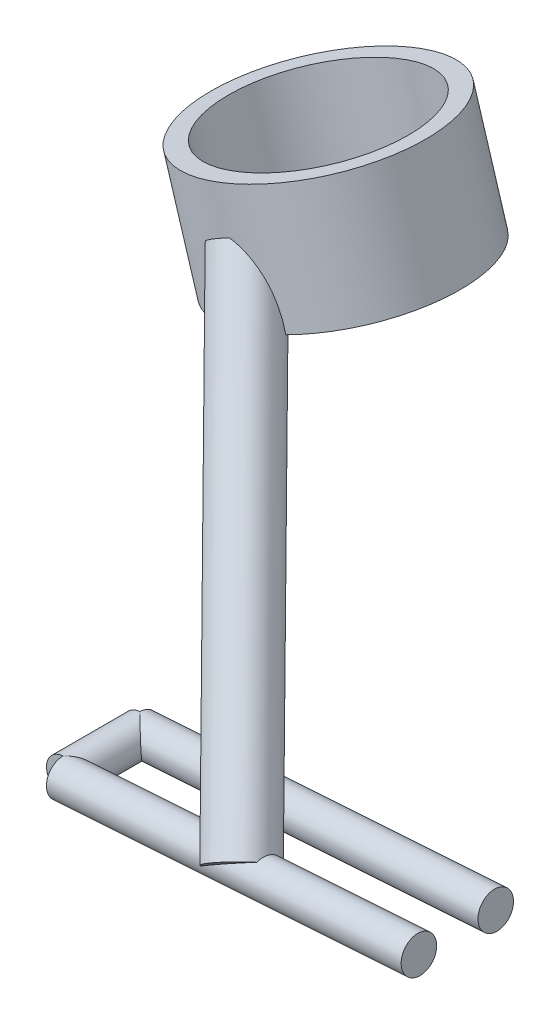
ISO-10303-21;
HEADER;
FILE_DESCRIPTION(('STEP AP214'),'2;1');
FILE_NAME('part.step','',(''),(''),'','','');
FILE_SCHEMA(('AUTOMOTIVE_DESIGN { 1 0 10303 214 1 1 1 1 }'));
ENDSEC;
DATA;
#1=APPLICATION_CONTEXT('core data for automotive mechanical design processes');
#2=APPLICATION_PROTOCOL_DEFINITION('international standard','automotive_design',2000,#1);
#3=PRODUCT_CONTEXT('',#1,'mechanical');
#4=PRODUCT('Part','Part','',(#3));
#5=PRODUCT_RELATED_PRODUCT_CATEGORY('part','',(#4));
#6=PRODUCT_DEFINITION_FORMATION('','',#4);
#7=PRODUCT_DEFINITION_CONTEXT('part definition',#1,'design');
#8=PRODUCT_DEFINITION('design','',#6,#7);
#9=PRODUCT_DEFINITION_SHAPE('','',#8);
#10=(LENGTH_UNIT() NAMED_UNIT(*) SI_UNIT(.MILLI.,.METRE.));
#11=(NAMED_UNIT(*) PLANE_ANGLE_UNIT() SI_UNIT($,.RADIAN.));
#12=(NAMED_UNIT(*) SI_UNIT($,.STERADIAN.) SOLID_ANGLE_UNIT());
#13=UNCERTAINTY_MEASURE_WITH_UNIT(LENGTH_MEASURE(1.E-05),#10,'distance_accuracy_value','');
#14=(GEOMETRIC_REPRESENTATION_CONTEXT(3) GLOBAL_UNCERTAINTY_ASSIGNED_CONTEXT((#13)) GLOBAL_UNIT_ASSIGNED_CONTEXT((#10,
#11,#12)) REPRESENTATION_CONTEXT('',''));
#15=CARTESIAN_POINT('',(0.,0.,0.));
#16=DIRECTION('',(0.,0.,1.));
#17=DIRECTION('',(1.,0.,0.));
#18=AXIS2_PLACEMENT_3D('',#15,#16,#17);
#19=CARTESIAN_POINT('',(-50.,118.,50.));
#20=DIRECTION('',(0.,0.,1.));
#21=DIRECTION('',(1.,0.,0.));
#22=AXIS2_PLACEMENT_3D('',#19,#20,#21);
#23=PLANE('',#22);
#24=CARTESIAN_POINT('',(-50.,118.,50.));
#25=DIRECTION('',(0.,0.,1.));
#26=DIRECTION('',(1.,0.,0.));
#27=AXIS2_PLACEMENT_3D('',#24,#25,#26);
#28=CIRCLE('',#27,3.);
#29=CARTESIAN_POINT('',(-50.1995570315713,120.99335547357,50.));
#30=VERTEX_POINT('',#29);
#31=CARTESIAN_POINT('',(-49.8004429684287,115.00664452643,50.));
#32=VERTEX_POINT('',#31);
#33=EDGE_CURVE('E399',#30,#32,#28,.T.);
#34=ORIENTED_EDGE('',*,*,#33,.T.);
#35=DIRECTION('',(-0.0665190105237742,0.997785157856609,0.));
#36=VECTOR('',#35,1.);
#37=CARTESIAN_POINT('',(-50.,118.,50.));
#38=LINE('',#37,#36);
#39=EDGE_CURVE('E201',#32,#30,#38,.T.);
#40=ORIENTED_EDGE('',*,*,#39,.T.);
#41=EDGE_LOOP('',(#34,#40));
#42=FACE_BOUND('',#41,.T.);
#43=ADVANCED_FACE('F70',(#42),#23,.T.);
#44=CARTESIAN_POINT('',(-50.,118.,37.));
#45=DIRECTION('',(0.997785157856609,0.0665190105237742,0.));
#46=DIRECTION('',(-0.0665190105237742,0.997785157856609,0.));
#47=AXIS2_PLACEMENT_3D('',#44,#45,#46);
#48=PLANE('',#47);
#49=DIRECTION('',(0.0665190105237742,-0.997785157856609,0.));
#50=VECTOR('',#49,1.);
#51=CARTESIAN_POINT('',(-50.,118.,37.));
#52=LINE('',#51,#50);
#53=CARTESIAN_POINT('',(-50.1995570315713,120.99335547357,37.));
#54=VERTEX_POINT('',#53);
#55=CARTESIAN_POINT('',(-49.8004429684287,115.00664452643,37.));
#56=VERTEX_POINT('',#55);
#57=EDGE_CURVE('E250',#54,#56,#52,.T.);
#58=ORIENTED_EDGE('',*,*,#57,.F.);
#59=CARTESIAN_POINT('',(-50.,118.,37.));
#60=DIRECTION('',(0.997785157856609,0.0665190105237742,0.));
#61=DIRECTION('',(-0.0665190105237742,0.997785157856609,0.));
#62=AXIS2_PLACEMENT_3D('',#59,#60,#61);
#63=CIRCLE('',#62,3.);
#64=EDGE_CURVE('E246',#56,#54,#63,.T.);
#65=ORIENTED_EDGE('',*,*,#64,.F.);
#66=EDGE_LOOP('',(#58,#65));
#67=FACE_BOUND('',#66,.T.);
#68=ADVANCED_FACE('F72',(#67),#48,.F.);
#69=CARTESIAN_POINT('',(10.,122.,37.));
#70=DIRECTION('',(0.997785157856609,0.0665190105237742,0.));
#71=DIRECTION('',(-0.0665190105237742,0.997785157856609,0.));
#72=AXIS2_PLACEMENT_3D('',#69,#70,#71);
#73=PLANE('',#72);
#74=CARTESIAN_POINT('',(10.,122.,37.));
#75=DIRECTION('',(0.997785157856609,0.0665190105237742,0.));
#76=DIRECTION('',(-0.0665190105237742,0.997785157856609,0.));
#77=AXIS2_PLACEMENT_3D('',#74,#75,#76);
#78=CIRCLE('',#77,3.);
#79=CARTESIAN_POINT('',(9.80044296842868,124.99335547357,37.));
#80=VERTEX_POINT('',#79);
#81=EDGE_CURVE('E243',#80,#80,#78,.T.);
#82=ORIENTED_EDGE('',*,*,#81,.T.);
#83=EDGE_LOOP('',(#82));
#84=FACE_BOUND('',#83,.T.);
#85=ADVANCED_FACE('F224',(#84),#73,.T.);
#86=CARTESIAN_POINT('',(-50.,118.,37.));
#87=DIRECTION('',(0.997785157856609,0.066519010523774,0.));
#88=DIRECTION('',(-0.066519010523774,0.997785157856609,0.));
#89=AXIS2_PLACEMENT_3D('',#86,#87,#88);
#90=CYLINDRICAL_SURFACE('',#89,3.);
#91=CARTESIAN_POINT('',(-50.,118.,37.));
#92=DIRECTION('',(0.705540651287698,0.0470360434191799,-0.707106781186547));
#93=DIRECTION('',(0.705540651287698,0.0470360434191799,0.707106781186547));
#94=AXIS2_PLACEMENT_3D('',#91,#92,#93);
#95=ELLIPSE('',#94,4.24264068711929,3.);
#96=EDGE_CURVE('E245',#56,#54,#95,.F.);
#97=ORIENTED_EDGE('',*,*,#96,.F.);
#98=ORIENTED_EDGE('',*,*,#64,.T.);
#99=EDGE_LOOP('',(#97,#98));
#100=FACE_BOUND('',#99,.T.);
#101=ORIENTED_EDGE('',*,*,#81,.F.);
#102=EDGE_LOOP('',(#101));
#103=FACE_BOUND('',#102,.T.);
#104=ADVANCED_FACE('F226',(#100,#103),#90,.T.);
#105=CARTESIAN_POINT('',(-50.,118.,37.));
#106=DIRECTION('',(0.,0.,1.));
#107=DIRECTION('',(1.,0.,0.));
#108=AXIS2_PLACEMENT_3D('',#105,#106,#107);
#109=PLANE('',#108);
#110=CARTESIAN_POINT('',(-50.,118.,37.));
#111=DIRECTION('',(0.,0.,1.));
#112=DIRECTION('',(1.,0.,0.));
#113=AXIS2_PLACEMENT_3D('',#110,#111,#112);
#114=CIRCLE('',#113,3.);
#115=EDGE_CURVE('E397',#54,#56,#114,.T.);
#116=ORIENTED_EDGE('',*,*,#115,.F.);
#117=ORIENTED_EDGE('',*,*,#57,.T.);
#118=EDGE_LOOP('',(#116,#117));
#119=FACE_BOUND('',#118,.T.);
#120=ADVANCED_FACE('F231',(#119),#109,.F.);
#121=CARTESIAN_POINT('',(-50.,118.,37.));
#122=DIRECTION('',(0.,0.,1.));
#123=DIRECTION('',(1.,0.,0.));
#124=AXIS2_PLACEMENT_3D('',#121,#122,#123);
#125=CYLINDRICAL_SURFACE('',#124,3.);
#126=CARTESIAN_POINT('',(-50.,118.,50.));
#127=DIRECTION('',(0.705540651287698,0.0470360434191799,0.707106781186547));
#128=DIRECTION('',(-0.705540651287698,-0.0470360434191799,0.707106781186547));
#129=AXIS2_PLACEMENT_3D('',#126,#127,#128);
#130=ELLIPSE('',#129,4.24264068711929,3.);
#131=EDGE_CURVE('E84',#32,#30,#130,.T.);
#132=ORIENTED_EDGE('',*,*,#131,.F.);
#133=ORIENTED_EDGE('',*,*,#33,.F.);
#134=EDGE_LOOP('',(#132,#133));
#135=FACE_BOUND('',#134,.T.);
#136=ORIENTED_EDGE('',*,*,#115,.T.);
#137=ORIENTED_EDGE('',*,*,#96,.T.);
#138=EDGE_LOOP('',(#136,#137));
#139=FACE_BOUND('',#138,.T.);
#140=ADVANCED_FACE('F229',(#135,#139),#125,.T.);
#141=CARTESIAN_POINT('',(-20.,120.,50.));
#142=DIRECTION('',(0.4544555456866,-0.75878267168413,0.466603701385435));
#143=DIRECTION('',(0.,-0.523820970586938,-0.851828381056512));
#144=AXIS2_PLACEMENT_3D('',#141,#142,#143);
#145=PLANE('',#144);
#146=CARTESIAN_POINT('',(-20.,120.,50.));
#147=DIRECTION('',(0.4544555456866,-0.75878267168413,0.466603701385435));
#148=DIRECTION('',(0.890123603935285,0.406780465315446,-0.205449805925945));
#149=AXIS2_PLACEMENT_3D('',#146,#147,#148);
#150=ELLIPSE('',#149,7.44462084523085,3.);
#151=CARTESIAN_POINT('',(-16.1920073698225,123.013296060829,51.1913181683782));
#152=VERTEX_POINT('',#151);
#153=CARTESIAN_POINT('',(-23.9727166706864,119.457564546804,52.9871869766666));
#154=VERTEX_POINT('',#153);
#155=EDGE_CURVE('E267',#152,#154,#150,.T.);
#156=ORIENTED_EDGE('',*,*,#155,.F.);
#157=CARTESIAN_POINT('',(-20.,120.,50.));
#158=DIRECTION('',(0.4544555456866,-0.75878267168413,0.466603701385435));
#159=DIRECTION('',(0.,-0.523820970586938,-0.851828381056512));
#160=AXIS2_PLACEMENT_3D('',#157,#158,#159);
#161=CIRCLE('',#160,4.99999999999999);
#162=EDGE_CURVE('E148',#152,#154,#161,.T.);
#163=ORIENTED_EDGE('',*,*,#162,.T.);
#164=EDGE_LOOP('',(#156,#163));
#165=FACE_BOUND('',#164,.T.);
#166=ADVANCED_FACE('F277',(#165),#145,.T.);
#167=CARTESIAN_POINT('',(-51.165048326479,167.353332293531,0.));
#168=DIRECTION('',(-0.292371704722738,0.956304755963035,0.));
#169=DIRECTION('',(-0.956304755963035,-0.292371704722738,0.));
#170=AXIS2_PLACEMENT_3D('',#167,#168,#169);
#171=PLANE('',#170);
#172=CARTESIAN_POINT('',(-48.7951496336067,168.077883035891,20.4351205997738));
#173=DIRECTION('',(-0.292371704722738,0.956304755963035,0.));
#174=DIRECTION('',(0.396739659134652,0.121295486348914,0.909881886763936));
#175=AXIS2_PLACEMENT_3D('',#172,#173,#174);
#176=ELLIPSE('',#175,5.82412932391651,4.99999999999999);
#177=CARTESIAN_POINT('',(-44.7359402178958,169.31890789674,17.7708492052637));
#178=VERTEX_POINT('',#177);
#179=CARTESIAN_POINT('',(-47.136958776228,168.584842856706,15.3319234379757));
#180=VERTEX_POINT('',#179);
#181=EDGE_CURVE('E140',#178,#180,#176,.T.);
#182=ORIENTED_EDGE('',*,*,#181,.T.);
#183=CARTESIAN_POINT('',(-51.165048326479,167.353332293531,0.));
#184=DIRECTION('',(-0.292371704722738,0.956304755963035,0.));
#185=DIRECTION('',(-0.956304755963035,-0.292371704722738,0.));
#186=AXIS2_PLACEMENT_3D('',#183,#184,#185);
#187=CIRCLE('',#186,15.9);
#188=CARTESIAN_POINT('',(-52.1660859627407,167.047284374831,15.8655052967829));
#189=VERTEX_POINT('',#188);
#190=EDGE_CURVE('E89',#180,#189,#187,.T.);
#191=ORIENTED_EDGE('',*,*,#190,.T.);
#192=CARTESIAN_POINT('',(-53.6483426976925,166.594113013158,18.8217118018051));
#193=VERTEX_POINT('',#192);
#194=EDGE_CURVE('E138',#189,#193,#176,.T.);
#195=ORIENTED_EDGE('',*,*,#194,.T.);
#196=CARTESIAN_POINT('',(-51.165048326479,167.353332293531,0.));
#197=DIRECTION('',(-0.292371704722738,0.956304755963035,0.));
#198=DIRECTION('',(-0.956304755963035,-0.292371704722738,0.));
#199=AXIS2_PLACEMENT_3D('',#196,#197,#198);
#200=CIRCLE('',#199,19.);
#201=EDGE_CURVE('E150',#178,#193,#200,.T.);
#202=ORIENTED_EDGE('',*,*,#201,.F.);
#203=EDGE_LOOP('',(#182,#191,#195,#202));
#204=FACE_BOUND('',#203,.T.);
#205=ADVANCED_FACE('F136',(#204),#171,.F.);
#206=CARTESIAN_POINT('',(-57.0124824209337,186.479427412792,0.));
#207=DIRECTION('',(-0.292371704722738,0.956304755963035,0.));
#208=DIRECTION('',(-0.956304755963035,-0.292371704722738,0.));
#209=AXIS2_PLACEMENT_3D('',#206,#207,#208);
#210=PLANE('',#209);
#211=CARTESIAN_POINT('',(-57.0124824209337,186.479427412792,0.));
#212=DIRECTION('',(-0.292371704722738,0.956304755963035,0.));
#213=DIRECTION('',(-0.956304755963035,-0.292371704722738,0.));
#214=AXIS2_PLACEMENT_3D('',#211,#212,#213);
#215=CIRCLE('',#214,15.9);
#216=CARTESIAN_POINT('',(-72.217728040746,181.8307173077,0.));
#217=VERTEX_POINT('',#216);
#218=EDGE_CURVE('E141',#217,#217,#215,.T.);
#219=ORIENTED_EDGE('',*,*,#218,.F.);
#220=EDGE_LOOP('',(#219));
#221=FACE_BOUND('',#220,.T.);
#222=CARTESIAN_POINT('',(-57.0124824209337,186.479427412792,0.));
#223=DIRECTION('',(-0.292371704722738,0.956304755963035,0.));
#224=DIRECTION('',(-0.956304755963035,-0.292371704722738,0.));
#225=AXIS2_PLACEMENT_3D('',#222,#223,#224);
#226=CIRCLE('',#225,19.);
#227=CARTESIAN_POINT('',(-75.1822727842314,180.92436502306,0.));
#228=VERTEX_POINT('',#227);
#229=EDGE_CURVE('E157',#228,#228,#226,.T.);
#230=ORIENTED_EDGE('',*,*,#229,.T.);
#231=EDGE_LOOP('',(#230));
#232=FACE_BOUND('',#231,.T.);
#233=ADVANCED_FACE('F290',(#221,#232),#210,.T.);
#234=CARTESIAN_POINT('',(-51.165048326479,167.353332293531,0.));
#235=DIRECTION('',(-0.292371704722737,0.956304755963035,0.));
#236=DIRECTION('',(-0.956304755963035,-0.292371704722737,0.));
#237=AXIS2_PLACEMENT_3D('',#234,#235,#236);
#238=CYLINDRICAL_SURFACE('',#237,19.);
#239=CARTESIAN_POINT('',(-44.7359402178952,169.31890789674,17.7708492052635));
#240=CARTESIAN_POINT('',(-44.7981550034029,169.57158532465,17.765398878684));
#241=CARTESIAN_POINT('',(-44.8653622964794,169.823064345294,17.7618880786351));
#242=CARTESIAN_POINT('',(-45.0094854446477,170.323251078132,17.7586950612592));
#243=CARTESIAN_POINT('',(-45.0864013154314,170.571958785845,17.7590128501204));
#244=CARTESIAN_POINT('',(-45.2497979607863,171.066630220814,17.7634301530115));
#245=CARTESIAN_POINT('',(-45.3362941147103,171.312588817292,17.7675358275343));
#246=CARTESIAN_POINT('',(-45.5186437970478,171.800903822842,17.7794796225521));
#247=CARTESIAN_POINT('',(-45.6144973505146,172.043260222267,17.7873177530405));
#248=CARTESIAN_POINT('',(-45.917987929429,172.768832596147,17.8165212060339));
#249=CARTESIAN_POINT('',(-46.1400283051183,173.245911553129,17.8435327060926));
#250=CARTESIAN_POINT('',(-46.6231111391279,174.178490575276,17.9116670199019));
#251=CARTESIAN_POINT('',(-46.8841215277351,174.634007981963,17.9527782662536));
#252=CARTESIAN_POINT('',(-47.3393952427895,175.347808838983,18.0293637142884));
#253=CARTESIAN_POINT('',(-47.5208546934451,175.614721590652,18.0609506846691));
#254=CARTESIAN_POINT('',(-47.9002340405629,176.136102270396,18.1283275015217));
#255=CARTESIAN_POINT('',(-48.0981539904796,176.390570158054,18.1641173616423));
#256=CARTESIAN_POINT('',(-48.5108207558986,176.884194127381,18.2390648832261));
#257=CARTESIAN_POINT('',(-48.7255360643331,177.123377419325,18.2782162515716));
#258=CARTESIAN_POINT('',(-49.172855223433,177.583944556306,18.3589085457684));
#259=CARTESIAN_POINT('',(-49.4054526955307,177.805334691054,18.4004486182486));
#260=CARTESIAN_POINT('',(-49.8129447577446,178.160173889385,18.4712832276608));
#261=CARTESIAN_POINT('',(-49.9829159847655,178.299345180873,18.5003101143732));
#262=CARTESIAN_POINT('',(-50.3317121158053,178.566100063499,18.5582802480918));
#263=CARTESIAN_POINT('',(-50.5105347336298,178.693686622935,18.5872235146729));
#264=CARTESIAN_POINT('',(-50.876449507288,178.935079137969,18.6442698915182));
#265=CARTESIAN_POINT('',(-51.0635081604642,179.048934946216,18.6723757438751));
#266=CARTESIAN_POINT('',(-51.4463185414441,179.261230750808,18.7270755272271));
#267=CARTESIAN_POINT('',(-51.6420664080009,179.359677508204,18.7536701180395));
#268=CARTESIAN_POINT('',(-52.0531993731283,179.543606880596,18.8058826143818));
#269=CARTESIAN_POINT('',(-52.2690709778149,179.628062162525,18.8313636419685));
#270=CARTESIAN_POINT('',(-52.5995407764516,179.736929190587,18.8666916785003));
#271=CARTESIAN_POINT('',(-52.711065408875,179.770303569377,18.8780075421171));
#272=CARTESIAN_POINT('',(-52.9360823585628,179.830437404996,18.8994860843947));
#273=CARTESIAN_POINT('',(-53.0495761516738,179.857191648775,18.9096478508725));
#274=CARTESIAN_POINT('',(-53.1639136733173,179.880325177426,18.9191424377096));
#275=B_SPLINE_CURVE_WITH_KNOTS('',3,(#239,#240,#241,#242,#243,#244,#245,#246,#247,#248,#249,
#250,#251,#252,#253,#254,#255,#256,#257,#258,#259,#260,#261,#262,#263,#264,#265,#266,#267,#268,
#269,#270,#271,#272,#273,#274),.UNSPECIFIED.,.F.,.F.,(4,2,2,2,2,2,2,2,2,2,2,2,2,2,2,2,2,4),(0.,
0.780768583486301,1.56153842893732,2.34358033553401,3.12562433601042,4.70432229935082,
6.28172818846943,7.25403359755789,8.22634216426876,9.19686857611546,10.1670503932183,
10.8314035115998,11.4955859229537,12.1572792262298,12.8186813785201,13.5169181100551,
13.8676129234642,14.2185830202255),.UNSPECIFIED.);
#276=CARTESIAN_POINT('',(-53.163913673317,179.880325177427,18.9191424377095));
#277=VERTEX_POINT('',#276);
#278=EDGE_CURVE('E183',#178,#277,#275,.T.);
#279=ORIENTED_EDGE('',*,*,#278,.F.);
#280=ORIENTED_EDGE('',*,*,#201,.T.);
#281=CARTESIAN_POINT('',(-57.3721179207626,177.259150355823,18.7552768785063));
#282=CARTESIAN_POINT('',(-57.3925154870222,177.153268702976,18.7470928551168));
#283=CARTESIAN_POINT('',(-57.4093735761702,177.046729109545,18.7392281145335));
#284=CARTESIAN_POINT('',(-57.4366442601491,176.832863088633,18.724180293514));
#285=CARTESIAN_POINT('',(-57.4470621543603,176.725537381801,18.716996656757));
#286=CARTESIAN_POINT('',(-57.4620874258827,176.510880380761,18.7033677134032));
#287=CARTESIAN_POINT('',(-57.4667177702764,176.403550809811,18.6969195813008));
#288=CARTESIAN_POINT('',(-57.4708081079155,176.188739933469,18.6847345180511));
#289=CARTESIAN_POINT('',(-57.4702669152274,176.081258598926,18.678997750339));
#290=CARTESIAN_POINT('',(-57.4617447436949,175.762093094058,18.6630070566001));
#291=CARTESIAN_POINT('',(-57.4470526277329,175.550522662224,18.6537730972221));
#292=CARTESIAN_POINT('',(-57.4028215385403,175.128666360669,18.6379013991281));
#293=CARTESIAN_POINT('',(-57.3732634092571,174.918382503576,18.6312670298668));
#294=CARTESIAN_POINT('',(-57.3055911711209,174.522218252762,18.6209699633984));
#295=CARTESIAN_POINT('',(-57.2687256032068,174.336126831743,18.6170658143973));
#296=CARTESIAN_POINT('',(-57.1864986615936,173.965784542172,18.6109977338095));
#297=CARTESIAN_POINT('',(-57.141135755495,173.781534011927,18.6088341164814));
#298=CARTESIAN_POINT('',(-57.0430153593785,173.414984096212,18.606080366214));
#299=CARTESIAN_POINT('',(-56.9902567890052,173.232685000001,18.605490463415));
#300=CARTESIAN_POINT('',(-56.878217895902,172.870094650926,18.6057243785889));
#301=CARTESIAN_POINT('',(-56.8189368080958,172.689803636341,18.6065483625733));
#302=CARTESIAN_POINT('',(-56.6307276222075,172.147136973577,18.6109503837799));
#303=CARTESIAN_POINT('',(-56.4927876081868,171.787882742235,18.6164875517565));
#304=CARTESIAN_POINT('',(-56.1974474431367,171.077756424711,18.6315938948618));
#305=CARTESIAN_POINT('',(-56.0400514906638,170.726882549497,18.6411622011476));
#306=CARTESIAN_POINT('',(-55.7142407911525,170.045380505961,18.662952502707));
#307=CARTESIAN_POINT('',(-55.5464014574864,169.714472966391,18.6750703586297));
#308=CARTESIAN_POINT('',(-55.1966307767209,169.060277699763,18.7013410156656));
#309=CARTESIAN_POINT('',(-55.0146987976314,168.736990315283,18.7154939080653));
#310=CARTESIAN_POINT('',(-54.6421762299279,168.105893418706,18.744742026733));
#311=CARTESIAN_POINT('',(-54.451897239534,167.797898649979,18.7598065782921));
#312=CARTESIAN_POINT('',(-54.1573837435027,167.341875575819,18.7828285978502));
#313=CARTESIAN_POINT('',(-54.0577062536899,167.19087623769,18.7905727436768));
#314=CARTESIAN_POINT('',(-53.8553082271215,166.89093342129,18.8061194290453));
#315=CARTESIAN_POINT('',(-53.7525876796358,166.741989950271,18.8139219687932));
#316=CARTESIAN_POINT('',(-53.6483426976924,166.594113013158,18.8217118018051));
#317=B_SPLINE_CURVE_WITH_KNOTS('',3,(#281,#282,#283,#284,#285,#286,#287,#288,#289,#290,#291,
#292,#293,#294,#295,#296,#297,#298,#299,#300,#301,#302,#303,#304,#305,#306,#307,#308,#309,#310,
#311,#312,#313,#314,#315,#316),.UNSPECIFIED.,.F.,.F.,(4,2,2,2,2,2,2,2,2,2,2,2,2,2,2,2,2,4),(0.,
0.324286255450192,0.648305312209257,0.97103441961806,1.29383753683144,1.92994926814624,
2.56688278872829,3.1358939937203,3.7050079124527,4.27420505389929,4.8434690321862,
5.9972587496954,7.15079991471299,8.26412718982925,9.37750442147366,10.4642247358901,
11.0074857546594,11.5507486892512),.UNSPECIFIED.);
#318=CARTESIAN_POINT('',(-57.3721179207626,177.259150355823,18.7552768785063));
#319=VERTEX_POINT('',#318);
#320=EDGE_CURVE('E147',#319,#193,#317,.T.);
#321=ORIENTED_EDGE('',*,*,#320,.F.);
#322=CARTESIAN_POINT('',(-51.705152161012,169.119932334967,0.));
#323=DIRECTION('',(0.4544555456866,-0.75878267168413,0.466603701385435));
#324=DIRECTION('',(0.190666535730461,0.594542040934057,0.781131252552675));
#325=AXIS2_PLACEMENT_3D('',#322,#323,#324);
#326=ELLIPSE('',#325,22.1316914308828,19.);
#327=EDGE_CURVE('E166',#319,#277,#326,.F.);
#328=ORIENTED_EDGE('',*,*,#327,.T.);
#329=EDGE_LOOP('',(#279,#280,#321,#328));
#330=FACE_BOUND('',#329,.T.);
#331=ORIENTED_EDGE('',*,*,#229,.F.);
#332=EDGE_LOOP('',(#331));
#333=FACE_BOUND('',#332,.T.);
#334=ADVANCED_FACE('F168',(#330,#333),#238,.T.);
#335=CARTESIAN_POINT('',(-54.0887653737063,176.916379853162,15.));
#336=DIRECTION('',(0.4544555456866,-0.75878267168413,0.466603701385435));
#337=DIRECTION('',(0.,-0.523820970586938,-0.851828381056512));
#338=AXIS2_PLACEMENT_3D('',#335,#336,#337);
#339=PLANE('',#338);
#340=ORIENTED_EDGE('',*,*,#327,.F.);
#341=CARTESIAN_POINT('',(-54.0887653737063,176.916379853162,15.));
#342=DIRECTION('',(0.4544555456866,-0.75878267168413,0.466603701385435));
#343=DIRECTION('',(0.,-0.523820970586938,-0.851828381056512));
#344=AXIS2_PLACEMENT_3D('',#341,#342,#343);
#345=CIRCLE('',#344,4.99999999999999);
#346=EDGE_CURVE('E268',#277,#319,#345,.T.);
#347=ORIENTED_EDGE('',*,*,#346,.F.);
#348=EDGE_LOOP('',(#340,#347));
#349=FACE_BOUND('',#348,.T.);
#350=ADVANCED_FACE('F208',(#349),#339,.F.);
#351=CARTESIAN_POINT('',(-23.8079926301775,116.986703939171,48.8086818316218));
#352=VERTEX_POINT('',#351);
#353=CARTESIAN_POINT('',(-16.0272833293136,120.542435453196,47.0128130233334));
#354=VERTEX_POINT('',#353);
#355=EDGE_CURVE('E261',#352,#354,#150,.T.);
#356=ORIENTED_EDGE('',*,*,#355,.F.);
#357=EDGE_CURVE('E152',#352,#354,#161,.T.);
#358=ORIENTED_EDGE('',*,*,#357,.T.);
#359=EDGE_LOOP('',(#356,#358));
#360=FACE_BOUND('',#359,.T.);
#361=ADVANCED_FACE('F177',(#360),#145,.T.);
#362=CARTESIAN_POINT('',(-54.0887653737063,176.916379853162,15.));
#363=DIRECTION('',(0.4544555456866,-0.75878267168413,0.466603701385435));
#364=DIRECTION('',(0.,-0.523820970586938,-0.851828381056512));
#365=AXIS2_PLACEMENT_3D('',#362,#363,#364);
#366=CYLINDRICAL_SURFACE('',#365,4.99999999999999);
#367=CARTESIAN_POINT('',(-49.8418224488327,179.551060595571,15.1480985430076));
#368=CARTESIAN_POINT('',(-49.7058619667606,179.333061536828,15.1269414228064));
#369=CARTESIAN_POINT('',(-49.5747597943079,179.111932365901,15.1071092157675));
#370=CARTESIAN_POINT('',(-49.3220923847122,178.664093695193,15.0703340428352));
#371=CARTESIAN_POINT('',(-49.2005258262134,178.437384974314,15.05339067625));
#372=CARTESIAN_POINT('',(-48.966667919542,177.97891916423,15.0226207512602));
#373=CARTESIAN_POINT('',(-48.8543801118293,177.747160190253,15.0087953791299));
#374=CARTESIAN_POINT('',(-48.6390182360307,177.279248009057,14.984434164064));
#375=CARTESIAN_POINT('',(-48.5359445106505,177.043094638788,14.9738984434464));
#376=CARTESIAN_POINT('',(-48.2391830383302,176.325790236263,14.9473194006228));
#377=CARTESIAN_POINT('',(-48.0593634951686,175.838570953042,14.9364934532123));
#378=CARTESIAN_POINT('',(-47.8179762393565,175.098728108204,14.931168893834));
#379=CARTESIAN_POINT('',(-47.7422418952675,174.850629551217,14.9312127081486));
#380=CARTESIAN_POINT('',(-47.6004888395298,174.35169899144,14.9349858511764));
#381=CARTESIAN_POINT('',(-47.5344692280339,174.100867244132,14.9387148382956));
#382=CARTESIAN_POINT('',(-47.4056799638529,173.568244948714,14.950544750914));
#383=CARTESIAN_POINT('',(-47.3441276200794,173.286168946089,14.9590934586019));
#384=CARTESIAN_POINT('',(-47.234580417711,172.719571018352,14.9808904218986));
#385=CARTESIAN_POINT('',(-47.1865849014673,172.435049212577,14.9941384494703));
#386=CARTESIAN_POINT('',(-47.1056618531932,171.864497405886,15.0253914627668));
#387=CARTESIAN_POINT('',(-47.0727143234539,171.578469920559,15.0433900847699));
#388=CARTESIAN_POINT('',(-47.0239597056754,171.005314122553,15.0842486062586));
#389=CARTESIAN_POINT('',(-47.0081469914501,170.718186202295,15.1071069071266));
#390=CARTESIAN_POINT('',(-46.9992557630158,170.260547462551,15.1475142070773));
#391=CARTESIAN_POINT('',(-46.9995539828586,170.09001541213,15.1634513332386));
#392=CARTESIAN_POINT('',(-47.0083777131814,169.749352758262,15.1971127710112));
#393=CARTESIAN_POINT('',(-47.0169015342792,169.579222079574,15.2148367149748));
#394=CARTESIAN_POINT('',(-47.0434498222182,169.240024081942,15.2520853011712));
#395=CARTESIAN_POINT('',(-47.0614659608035,169.070955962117,15.2716083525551));
#396=CARTESIAN_POINT('',(-47.108712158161,168.734655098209,15.3124744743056));
#397=CARTESIAN_POINT('',(-47.1379370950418,168.567421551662,15.3338167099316));
#398=CARTESIAN_POINT('',(-47.216345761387,168.206303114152,15.3823037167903));
#399=CARTESIAN_POINT('',(-47.2681690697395,168.013017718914,15.4098026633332));
#400=CARTESIAN_POINT('',(-47.3958020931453,167.634690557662,15.4671207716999));
#401=CARTESIAN_POINT('',(-47.4715840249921,167.449639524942,15.4969372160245));
#402=CARTESIAN_POINT('',(-47.6271838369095,167.147392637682,15.549189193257));
#403=CARTESIAN_POINT('',(-47.6992954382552,167.026216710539,15.5712238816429));
#404=CARTESIAN_POINT('',(-47.8613974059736,166.796453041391,15.6155010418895));
#405=CARTESIAN_POINT('',(-47.9513545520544,166.687842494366,15.6377430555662));
#406=CARTESIAN_POINT('',(-48.1301840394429,166.509527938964,15.6769936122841));
#407=CARTESIAN_POINT('',(-48.215581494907,166.436399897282,15.6941492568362));
#408=CARTESIAN_POINT('',(-48.3977049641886,166.305613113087,15.7272196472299));
#409=CARTESIAN_POINT('',(-48.494419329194,166.247938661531,15.7431356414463));
#410=CARTESIAN_POINT('',(-48.6970437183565,166.150498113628,15.7730324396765));
#411=CARTESIAN_POINT('',(-48.8029737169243,166.11077213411,15.7870088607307));
#412=CARTESIAN_POINT('',(-49.0203655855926,166.050029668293,15.8124728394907));
#413=CARTESIAN_POINT('',(-49.131832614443,166.029030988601,15.8239580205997));
#414=CARTESIAN_POINT('',(-49.3864156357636,166.00120095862,15.846933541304));
#415=CARTESIAN_POINT('',(-49.5301482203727,165.999545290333,15.8576314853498));
#416=CARTESIAN_POINT('',(-49.8162709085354,166.018908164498,15.8750972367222));
#417=CARTESIAN_POINT('',(-49.9586578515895,166.039970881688,15.8818573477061));
#418=CARTESIAN_POINT('',(-50.2159439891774,166.094577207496,15.8911845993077));
#419=CARTESIAN_POINT('',(-50.3314305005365,166.125418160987,15.8942664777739));
#420=CARTESIAN_POINT('',(-50.5594374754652,166.1968329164,15.8984792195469));
#421=CARTESIAN_POINT('',(-50.6719557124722,166.237413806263,15.8996086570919));
#422=CARTESIAN_POINT('',(-50.8940806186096,166.32649959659,15.9002206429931));
#423=CARTESIAN_POINT('',(-51.0036797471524,166.37502306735,15.8996992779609));
#424=CARTESIAN_POINT('',(-51.2197432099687,166.478455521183,15.8972592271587));
#425=CARTESIAN_POINT('',(-51.3262083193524,166.533362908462,15.8953408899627));
#426=CARTESIAN_POINT('',(-51.5718183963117,166.667973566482,15.8894679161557));
#427=CARTESIAN_POINT('',(-51.709801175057,166.749770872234,15.8850433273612));
#428=CARTESIAN_POINT('',(-51.9809988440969,166.920866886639,15.874470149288));
#429=CARTESIAN_POINT('',(-52.1142116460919,167.010168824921,15.8683208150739));
#430=CARTESIAN_POINT('',(-52.3764625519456,167.194972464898,15.8545968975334));
#431=CARTESIAN_POINT('',(-52.5054942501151,167.290483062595,15.8470202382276));
#432=CARTESIAN_POINT('',(-52.7595945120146,167.486557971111,15.8306888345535));
#433=CARTESIAN_POINT('',(-52.8846623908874,167.587123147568,15.8219338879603));
#434=CARTESIAN_POINT('',(-53.2564719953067,167.896854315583,15.7940522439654));
#435=CARTESIAN_POINT('',(-53.4976958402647,168.11252338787,15.7734272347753));
#436=CARTESIAN_POINT('',(-53.9674913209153,168.556428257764,15.7294374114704));
#437=CARTESIAN_POINT('',(-54.1960731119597,168.784653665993,15.7060748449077));
#438=CARTESIAN_POINT('',(-54.6167273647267,169.22434938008,15.6602489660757));
#439=CARTESIAN_POINT('',(-54.8099733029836,169.434723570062,15.6379917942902));
#440=CARTESIAN_POINT('',(-55.1888194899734,169.86216373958,15.5924615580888));
#441=CARTESIAN_POINT('',(-55.3744188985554,170.079230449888,15.5691883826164));
#442=CARTESIAN_POINT('',(-55.738693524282,170.519349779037,15.5220141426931));
#443=CARTESIAN_POINT('',(-55.9173623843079,170.742407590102,15.4981125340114));
#444=CARTESIAN_POINT('',(-56.2680051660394,171.193700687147,15.4500683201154));
#445=CARTESIAN_POINT('',(-56.4399789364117,171.421936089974,15.4259257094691));
#446=CARTESIAN_POINT('',(-56.7711008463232,171.874424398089,15.3786580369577));
#447=CARTESIAN_POINT('',(-56.9304880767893,172.098502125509,15.3555289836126));
#448=CARTESIAN_POINT('',(-57.2433864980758,172.550763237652,15.309678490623));
#449=CARTESIAN_POINT('',(-57.3968976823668,172.778946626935,15.2869570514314));
#450=CARTESIAN_POINT('',(-57.6977281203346,173.238767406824,15.2422824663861));
#451=CARTESIAN_POINT('',(-57.8450593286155,173.470396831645,15.2203278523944));
#452=CARTESIAN_POINT('',(-58.1336905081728,173.937475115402,15.1774820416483));
#453=CARTESIAN_POINT('',(-58.274990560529,174.172923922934,15.1565908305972));
#454=CARTESIAN_POINT('',(-58.4131923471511,174.410242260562,15.1364027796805));
#455=B_SPLINE_CURVE_WITH_KNOTS('',3,(#367,#368,#369,#370,#371,#372,#373,#374,#375,#376,#377,
#378,#379,#380,#381,#382,#383,#384,#385,#386,#387,#388,#389,#390,#391,#392,#393,#394,#395,#396,
#397,#398,#399,#400,#401,#402,#403,#404,#405,#406,#407,#408,#409,#410,#411,#412,#413,#414,#415,
#416,#417,#418,#419,#420,#421,#422,#423,#424,#425,#426,#427,#428,#429,#430,#431,#432,#433,#434,
#435,#436,#437,#438,#439,#440,#441,#442,#443,#444,#445,#446,#447,#448,#449,#450,#451,#452,#453,
#454),.UNSPECIFIED.,.F.,.F.,(4,2,2,2,2,2,2,2,2,2,2,2,2,2,2,2,2,2,2,2,2,2,2,2,2,2,2,2,2,2,2,2,2,
2,2,2,2,2,2,2,2,2,2,4),(0.,0.773269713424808,1.54643208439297,2.31988811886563,3.09337290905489,
4.64967186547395,5.42771019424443,6.2056764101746,7.07185462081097,7.93799080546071,
8.80297258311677,9.6676702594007,10.1813281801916,10.6948806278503,11.2079832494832,
11.7208516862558,12.3257047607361,12.9298589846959,13.356772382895,13.7828983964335,
14.1226645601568,14.4620840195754,14.8022584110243,15.1427559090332,15.5727666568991,
16.0036150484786,16.3618301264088,16.720306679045,17.0796336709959,17.4388710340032,
17.9199406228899,18.401218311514,18.8832014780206,19.365267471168,20.3372450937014,
21.3084302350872,22.167802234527,23.0272684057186,23.8875051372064,24.7477613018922,
25.5755254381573,26.4032904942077,27.2293725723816,28.0554435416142),.UNSPECIFIED.);
#456=EDGE_CURVE('E12',#180,#189,#455,.T.);
#457=ORIENTED_EDGE('',*,*,#456,.F.);
#458=ORIENTED_EDGE('',*,*,#181,.F.);
#459=ORIENTED_EDGE('',*,*,#278,.T.);
#460=ORIENTED_EDGE('',*,*,#346,.T.);
#461=ORIENTED_EDGE('',*,*,#320,.T.);
#462=ORIENTED_EDGE('',*,*,#194,.F.);
#463=EDGE_LOOP('',(#457,#458,#459,#460,#461,#462));
#464=FACE_BOUND('',#463,.T.);
#465=CARTESIAN_POINT('',(-26.5232161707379,122.571778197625,50.));
#466=CARTESIAN_POINT('',(-26.5862414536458,122.567577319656,49.8800293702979));
#467=CARTESIAN_POINT('',(-26.6445665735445,122.556486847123,49.7576946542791));
#468=CARTESIAN_POINT('',(-26.7484102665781,122.518968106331,49.5096596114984));
#469=CARTESIAN_POINT('',(-26.7939197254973,122.492528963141,49.3839569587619));
#470=CARTESIAN_POINT('',(-26.8498921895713,122.440347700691,49.1945133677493));
#471=CARTESIAN_POINT('',(-26.866558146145,122.420723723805,49.1308647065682));
#472=CARTESIAN_POINT('',(-26.895199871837,122.37722073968,49.003981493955));
#473=CARTESIAN_POINT('',(-26.9071780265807,122.353343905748,48.9407467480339));
#474=CARTESIAN_POINT('',(-26.9260565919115,122.301392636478,48.8153224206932));
#475=CARTESIAN_POINT('',(-26.932962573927,122.273322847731,48.7531317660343));
#476=CARTESIAN_POINT('',(-26.9414699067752,122.213147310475,48.6303870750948));
#477=CARTESIAN_POINT('',(-26.9430720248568,122.181042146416,48.5698328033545));
#478=CARTESIAN_POINT('',(-26.9399857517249,122.087146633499,48.4057290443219));
#479=CARTESIAN_POINT('',(-26.9295893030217,122.021343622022,48.3044899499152));
#480=CARTESIAN_POINT('',(-26.8926457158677,121.880284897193,48.1121411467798));
#481=CARTESIAN_POINT('',(-26.8660921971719,121.805025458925,48.0210354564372));
#482=CARTESIAN_POINT('',(-26.8000728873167,121.650287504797,47.8535546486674));
#483=CARTESIAN_POINT('',(-26.7610584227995,121.571027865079,47.7767948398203));
#484=CARTESIAN_POINT('',(-26.6723534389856,121.408259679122,47.6349608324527));
#485=CARTESIAN_POINT('',(-26.6226597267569,121.324749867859,47.5698901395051));
#486=CARTESIAN_POINT('',(-26.4837139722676,121.10579954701,47.4167601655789));
#487=CARTESIAN_POINT('',(-26.3882337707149,120.968328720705,47.3372535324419));
#488=CARTESIAN_POINT('',(-26.1842229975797,120.690220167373,47.2043576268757));
#489=CARTESIAN_POINT('',(-26.0756521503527,120.549573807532,47.1510516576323));
#490=CARTESIAN_POINT('',(-25.8883801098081,120.313477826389,47.0820582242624));
#491=CARTESIAN_POINT('',(-25.8115830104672,120.218358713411,47.0597654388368));
#492=CARTESIAN_POINT('',(-25.6562049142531,120.027637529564,47.0255598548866));
#493=CARTESIAN_POINT('',(-25.577623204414,119.932035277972,47.0136512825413));
#494=CARTESIAN_POINT('',(-25.4200390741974,119.740448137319,47.000017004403));
#495=CARTESIAN_POINT('',(-25.3410366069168,119.644463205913,46.998292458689));
#496=CARTESIAN_POINT('',(-25.1839404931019,119.452147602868,47.0050845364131));
#497=CARTESIAN_POINT('',(-25.1058465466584,119.355817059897,47.0135976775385));
#498=CARTESIAN_POINT('',(-24.9687378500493,119.183893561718,47.0381853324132));
#499=CARTESIAN_POINT('',(-24.9092782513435,119.108362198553,47.0522045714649));
#500=CARTESIAN_POINT('',(-24.7924936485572,118.957199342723,47.086969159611));
#501=CARTESIAN_POINT('',(-24.7351691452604,118.881567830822,47.1077160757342));
#502=CARTESIAN_POINT('',(-24.5678781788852,118.655080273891,47.1804888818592));
#503=CARTESIAN_POINT('',(-24.4621908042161,118.504136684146,47.2431128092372));
#504=CARTESIAN_POINT('',(-24.2916454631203,118.239534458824,47.3819822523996));
#505=CARTESIAN_POINT('',(-24.2229460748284,118.125104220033,47.4520254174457));
#506=CARTESIAN_POINT('',(-24.1005210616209,117.901880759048,47.6115617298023));
#507=CARTESIAN_POINT('',(-24.0467810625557,117.793082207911,47.7010360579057));
#508=CARTESIAN_POINT('',(-23.9560432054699,117.585198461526,47.8988966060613));
#509=CARTESIAN_POINT('',(-23.9191158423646,117.486155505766,48.0073598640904));
#510=CARTESIAN_POINT('',(-23.8618066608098,117.302975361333,48.2401436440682));
#511=CARTESIAN_POINT('',(-23.8414338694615,117.218846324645,48.3644727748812));
#512=CARTESIAN_POINT('',(-23.8151902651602,117.073338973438,48.6177622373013));
#513=CARTESIAN_POINT('',(-23.8085703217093,117.010949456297,48.746071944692));
#514=CARTESIAN_POINT('',(-23.804311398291,116.904495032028,49.0101899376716));
#515=CARTESIAN_POINT('',(-23.8066747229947,116.860434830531,49.1460001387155));
#516=CARTESIAN_POINT('',(-23.817671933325,116.788191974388,49.4363763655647));
#517=CARTESIAN_POINT('',(-23.8269230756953,116.762096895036,49.5914390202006));
#518=CARTESIAN_POINT('',(-23.8486040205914,116.734222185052,49.9035335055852));
#519=CARTESIAN_POINT('',(-23.8610349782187,116.73245140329,50.0605660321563));
#520=CARTESIAN_POINT('',(-23.8869996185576,116.754269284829,50.3847653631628));
#521=CARTESIAN_POINT('',(-23.9005459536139,116.779774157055,50.5518066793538));
#522=CARTESIAN_POINT('',(-23.9251013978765,116.858762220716,50.8793371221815));
#523=CARTESIAN_POINT('',(-23.9361106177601,116.912244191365,51.0398265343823));
#524=CARTESIAN_POINT('',(-23.9539163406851,117.0452914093,51.34833056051));
#525=CARTESIAN_POINT('',(-23.9607460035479,117.124643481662,51.4964351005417));
#526=CARTESIAN_POINT('',(-23.9698803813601,117.307253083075,51.7772275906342));
#527=CARTESIAN_POINT('',(-23.9721854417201,117.410508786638,51.9099167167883));
#528=CARTESIAN_POINT('',(-23.9729558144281,117.636184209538,52.1543275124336));
#529=CARTESIAN_POINT('',(-23.9714752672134,117.758310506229,52.2663205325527));
#530=CARTESIAN_POINT('',(-23.9665133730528,118.019289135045,52.46872100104));
#531=CARTESIAN_POINT('',(-23.9630316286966,118.158144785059,52.5591241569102));
#532=CARTESIAN_POINT('',(-23.956749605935,118.451533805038,52.7175505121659));
#533=CARTESIAN_POINT('',(-23.9539636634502,118.606316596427,52.7851116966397));
#534=CARTESIAN_POINT('',(-23.9531452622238,118.925166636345,52.8935972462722));
#535=CARTESIAN_POINT('',(-23.9551141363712,119.089236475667,52.9345141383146));
#536=CARTESIAN_POINT('',(-23.9653043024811,119.338049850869,52.9748433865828));
#537=CARTESIAN_POINT('',(-23.9698988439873,119.421353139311,52.9847793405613));
#538=CARTESIAN_POINT('',(-23.9821490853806,119.588264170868,52.9976207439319));
#539=CARTESIAN_POINT('',(-23.989803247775,119.671871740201,53.0005297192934));
#540=CARTESIAN_POINT('',(-24.0087869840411,119.838530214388,52.999312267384));
#541=CARTESIAN_POINT('',(-24.0201126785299,119.921581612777,52.9951932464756));
#542=CARTESIAN_POINT('',(-24.0469864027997,120.086361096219,52.9800452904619));
#543=CARTESIAN_POINT('',(-24.0625338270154,120.168089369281,52.9690173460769));
#544=CARTESIAN_POINT('',(-24.0964275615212,120.321147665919,52.9417658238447));
#545=CARTESIAN_POINT('',(-24.1143295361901,120.392691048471,52.9261833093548));
#546=CARTESIAN_POINT('',(-24.1540032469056,120.533403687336,52.8899315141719));
#547=CARTESIAN_POINT('',(-24.1757762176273,120.602572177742,52.8692606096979));
#548=CARTESIAN_POINT('',(-24.2231661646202,120.73792928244,52.8232206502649));
#549=CARTESIAN_POINT('',(-24.2487815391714,120.804119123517,52.7978535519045));
#550=CARTESIAN_POINT('',(-24.3036944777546,120.933124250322,52.7428525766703));
#551=CARTESIAN_POINT('',(-24.3329934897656,120.995938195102,52.7132170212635));
#552=CARTESIAN_POINT('',(-24.4227504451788,121.172410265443,52.6219107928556));
#553=CARTESIAN_POINT('',(-24.4876457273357,121.281314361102,52.5552884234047));
#554=CARTESIAN_POINT('',(-24.6269577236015,121.484909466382,52.4113410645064));
#555=CARTESIAN_POINT('',(-24.7013804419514,121.579591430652,52.334009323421));
#556=CARTESIAN_POINT('',(-24.8401044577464,121.736242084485,52.1883838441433));
#557=CARTESIAN_POINT('',(-24.90315076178,121.800870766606,52.1217115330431));
#558=CARTESIAN_POINT('',(-25.032060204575,121.921984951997,51.9837826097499));
#559=CARTESIAN_POINT('',(-25.0979247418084,121.978466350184,51.9125237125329));
#560=CARTESIAN_POINT('',(-25.2314975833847,122.083768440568,51.7656785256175));
#561=CARTESIAN_POINT('',(-25.2992110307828,122.132564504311,51.6900793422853));
#562=CARTESIAN_POINT('',(-25.4352267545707,122.222549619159,51.5350306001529));
#563=CARTESIAN_POINT('',(-25.503528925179,122.263740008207,51.4555817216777));
#564=CARTESIAN_POINT('',(-25.6416658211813,122.339705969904,51.2906636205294));
#565=CARTESIAN_POINT('',(-25.7114904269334,122.37427161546,51.2050884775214));
#566=CARTESIAN_POINT('',(-25.8496746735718,122.43548121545,51.0300507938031));
#567=CARTESIAN_POINT('',(-25.9180338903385,122.462122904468,50.9405871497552));
#568=CARTESIAN_POINT('',(-26.1187208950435,122.529633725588,50.6670931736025));
#569=CARTESIAN_POINT('',(-26.2474965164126,122.558540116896,50.4769888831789));
#570=CARTESIAN_POINT('',(-26.3931431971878,122.571639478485,50.234051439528));
#571=CARTESIAN_POINT('',(-26.4200747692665,122.57312238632,50.187791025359));
#572=CARTESIAN_POINT('',(-26.4726550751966,122.574022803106,50.0944772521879));
#573=CARTESIAN_POINT('',(-26.4983028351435,122.573438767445,50.0474233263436));
#574=CARTESIAN_POINT('',(-26.5232161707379,122.571778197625,50.));
#575=B_SPLINE_CURVE_WITH_KNOTS('',3,(#465,#466,#467,#468,#469,#470,#471,#472,#473,#474,#475,
#476,#477,#478,#479,#480,#481,#482,#483,#484,#485,#486,#487,#488,#489,#490,#491,#492,#493,#494,
#495,#496,#497,#498,#499,#500,#501,#502,#503,#504,#505,#506,#507,#508,#509,#510,#511,#512,#513,
#514,#515,#516,#517,#518,#519,#520,#521,#522,#523,#524,#525,#526,#527,#528,#529,#530,#531,#532,
#533,#534,#535,#536,#537,#538,#539,#540,#541,#542,#543,#544,#545,#546,#547,#548,#549,#550,#551,
#552,#553,#554,#555,#556,#557,#558,#559,#560,#561,#562,#563,#564,#565,#566,#567,#568,#569,#570,
#571,#572,#573,#574),.UNSPECIFIED.,.T.,.F.,(4,2,2,2,2,2,2,2,2,2,2,2,2,2,2,2,2,2,2,2,2,2,2,2,2,2,
2,2,2,2,2,2,2,2,2,2,2,2,2,2,2,2,2,2,2,2,2,2,2,2,2,2,2,2,4),(0.,0.406615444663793,
0.813519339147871,1.01924682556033,1.22486948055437,1.4302659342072,1.63563267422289,
1.99712254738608,2.3587552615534,2.70854525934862,3.05843998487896,3.61124863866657,
4.1658037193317,4.53818543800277,4.91071863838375,5.28329427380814,5.65574321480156,
5.94692174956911,6.23816815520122,6.81875440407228,7.26916543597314,7.71914217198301,
8.17098865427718,8.62308136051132,9.04982325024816,9.47667462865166,9.94723061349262,
10.4179577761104,10.924068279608,11.4301567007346,11.9321760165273,12.4341570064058,
12.928999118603,13.4239395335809,13.9283635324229,14.4329289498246,14.6847009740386,
14.9363466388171,15.1877272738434,15.4390718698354,15.6649018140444,15.890803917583,
16.1166121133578,16.3425093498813,16.7703791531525,17.1985199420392,17.5347886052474,
17.871226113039,18.2087207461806,18.5461559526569,18.8929626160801,19.239868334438,
19.9296372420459,20.090248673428,20.2509801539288),.UNSPECIFIED.);
#576=EDGE_CURVE('E195',#154,#352,#575,.T.);
#577=ORIENTED_EDGE('',*,*,#576,.F.);
#578=ORIENTED_EDGE('',*,*,#162,.F.);
#579=CARTESIAN_POINT('',(-16.1435824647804,123.263753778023,50.));
#580=CARTESIAN_POINT('',(-16.1561610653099,123.262910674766,50.1625512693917));
#581=CARTESIAN_POINT('',(-16.1679671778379,123.248845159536,50.3253134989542));
#582=CARTESIAN_POINT('',(-16.1862222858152,123.194696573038,50.6470885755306));
#583=CARTESIAN_POINT('',(-16.1926581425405,123.15455011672,50.806091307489));
#584=CARTESIAN_POINT('',(-16.1954533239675,123.049201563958,51.1163619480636));
#585=CARTESIAN_POINT('',(-16.1917803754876,122.983919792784,51.2676035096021));
#586=CARTESIAN_POINT('',(-16.169191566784,122.830766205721,51.5567711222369));
#587=CARTESIAN_POINT('',(-16.150302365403,122.742934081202,51.6947199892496));
#588=CARTESIAN_POINT('',(-16.0954401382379,122.556099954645,51.9430001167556));
#589=CARTESIAN_POINT('',(-16.0608395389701,122.45841131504,52.0546213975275));
#590=CARTESIAN_POINT('',(-15.9742717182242,122.25196722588,52.2593120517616));
#591=CARTESIAN_POINT('',(-15.9223050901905,122.143212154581,52.3523820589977));
#592=CARTESIAN_POINT('',(-15.8064902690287,121.926417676,52.5135191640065));
#593=CARTESIAN_POINT('',(-15.743575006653,121.81874952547,52.5827761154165));
#594=CARTESIAN_POINT('',(-15.6067509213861,121.600845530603,52.7043211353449));
#595=CARTESIAN_POINT('',(-15.5328339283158,121.490607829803,52.7565965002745));
#596=CARTESIAN_POINT('',(-15.3946451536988,121.294378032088,52.8352496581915));
#597=CARTESIAN_POINT('',(-15.331945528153,121.208511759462,52.8648079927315));
#598=CARTESIAN_POINT('',(-15.203072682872,121.036759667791,52.9149544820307));
#599=CARTESIAN_POINT('',(-15.1368989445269,120.950873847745,52.9355412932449));
#600=CARTESIAN_POINT('',(-15.0020729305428,120.77909361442,52.968245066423));
#601=CARTESIAN_POINT('',(-14.9334146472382,120.693199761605,52.9803398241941));
#602=CARTESIAN_POINT('',(-14.7948237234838,120.521708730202,52.9962990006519));
#603=CARTESIAN_POINT('',(-14.7248912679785,120.436111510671,53.0001646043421));
#604=CARTESIAN_POINT('',(-14.5827187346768,120.262812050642,52.9998198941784));
#605=CARTESIAN_POINT('',(-14.510469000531,120.175118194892,52.995379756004));
#606=CARTESIAN_POINT('',(-14.3665969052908,120.000039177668,52.9779478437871));
#607=CARTESIAN_POINT('',(-14.2949746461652,119.912654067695,52.9649547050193));
#608=CARTESIAN_POINT('',(-14.1535155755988,119.738409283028,52.9302379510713));
#609=CARTESIAN_POINT('',(-14.0836758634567,119.651548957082,52.9085296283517));
#610=CARTESIAN_POINT('',(-13.9468207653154,119.478408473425,52.856021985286));
#611=CARTESIAN_POINT('',(-13.8798042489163,119.39212809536,52.8252263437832));
#612=CARTESIAN_POINT('',(-13.7240911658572,119.186374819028,52.7399118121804));
#613=CARTESIAN_POINT('',(-13.6373112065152,119.067279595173,52.6808276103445));
#614=CARTESIAN_POINT('',(-13.4761829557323,118.832537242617,52.5423314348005));
#615=CARTESIAN_POINT('',(-13.4018164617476,118.716885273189,52.4629496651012));
#616=CARTESIAN_POINT('',(-13.2839496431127,118.514424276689,52.300603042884));
#617=CARTESIAN_POINT('',(-13.2372532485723,118.426438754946,52.2214605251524));
#618=CARTESIAN_POINT('',(-13.1585584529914,118.257237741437,52.0497121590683));
#619=CARTESIAN_POINT('',(-13.1265472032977,118.176016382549,51.9571181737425));
#620=CARTESIAN_POINT('',(-13.079753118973,118.022817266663,51.7594881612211));
#621=CARTESIAN_POINT('',(-13.0650848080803,117.950903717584,51.6543744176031));
#622=CARTESIAN_POINT('',(-13.0546683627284,117.819867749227,51.4355911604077));
#623=CARTESIAN_POINT('',(-13.0589170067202,117.760743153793,51.3219231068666));
#624=CARTESIAN_POINT('',(-13.0841519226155,117.662275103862,51.1020186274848));
#625=CARTESIAN_POINT('',(-13.1034020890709,117.62153587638,50.9961931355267));
#626=CARTESIAN_POINT('',(-13.1547517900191,117.5519777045,50.783794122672));
#627=CARTESIAN_POINT('',(-13.1868568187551,117.523163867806,50.6772203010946));
#628=CARTESIAN_POINT('',(-13.2771635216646,117.467472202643,50.4217250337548));
#629=CARTESIAN_POINT('',(-13.3406673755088,117.446283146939,50.2734469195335));
#630=CARTESIAN_POINT('',(-13.4828987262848,117.424310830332,49.9827326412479));
#631=CARTESIAN_POINT('',(-13.5616608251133,117.423574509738,49.8403106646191));
#632=CARTESIAN_POINT('',(-13.7044939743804,117.43773758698,49.603936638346));
#633=CARTESIAN_POINT('',(-13.7660221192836,117.448077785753,49.5081054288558));
#634=CARTESIAN_POINT('',(-13.8927623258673,117.477131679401,49.3201690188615));
#635=CARTESIAN_POINT('',(-13.9579759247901,117.49584889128,49.2280654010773));
#636=CARTESIAN_POINT('',(-14.0909664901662,117.541272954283,49.0475172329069));
#637=CARTESIAN_POINT('',(-14.158747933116,117.567994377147,48.9590796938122));
#638=CARTESIAN_POINT('',(-14.2956777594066,117.629189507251,48.78605633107));
#639=CARTESIAN_POINT('',(-14.3648259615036,117.663662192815,48.7014700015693));
#640=CARTESIAN_POINT('',(-14.5054555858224,117.741426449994,48.5338215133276));
#641=CARTESIAN_POINT('',(-14.5769473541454,117.784941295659,48.4508714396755));
#642=CARTESIAN_POINT('',(-14.7192014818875,117.880315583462,48.2892051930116));
#643=CARTESIAN_POINT('',(-14.7899636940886,117.932176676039,48.2104898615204));
#644=CARTESIAN_POINT('',(-14.9293796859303,118.044439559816,48.0577975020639));
#645=CARTESIAN_POINT('',(-14.9980380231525,118.104821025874,47.983809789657));
#646=CARTESIAN_POINT('',(-15.132030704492,118.234592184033,47.840981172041));
#647=CARTESIAN_POINT('',(-15.1973668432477,118.303976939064,47.7721374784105));
#648=CARTESIAN_POINT('',(-15.3447580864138,118.477507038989,47.6179106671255));
#649=CARTESIAN_POINT('',(-15.4249185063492,118.585438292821,47.5348911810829));
#650=CARTESIAN_POINT('',(-15.5725923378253,118.818504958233,47.3828491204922));
#651=CARTESIAN_POINT('',(-15.6401238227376,118.943615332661,47.3138065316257));
#652=CARTESIAN_POINT('',(-15.7297196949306,119.143207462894,47.2235877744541));
#653=CARTESIAN_POINT('',(-15.7577337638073,119.212062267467,47.1956441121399));
#654=CARTESIAN_POINT('',(-15.8095200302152,119.353155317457,47.1448705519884));
#655=CARTESIAN_POINT('',(-15.8332940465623,119.425392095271,47.1220384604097));
#656=CARTESIAN_POINT('',(-15.876547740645,119.572673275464,47.0819391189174));
#657=CARTESIAN_POINT('',(-15.8960258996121,119.647718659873,47.0646738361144));
#658=CARTESIAN_POINT('',(-15.9308201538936,119.799850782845,47.0360682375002));
#659=CARTESIAN_POINT('',(-15.9461364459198,119.876937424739,47.0247276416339));
#660=CARTESIAN_POINT('',(-15.9834980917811,120.093969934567,47.0016936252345));
#661=CARTESIAN_POINT('',(-16.0012932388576,120.235440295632,46.9968064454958));
#662=CARTESIAN_POINT('',(-16.0271977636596,120.518412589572,47.0072992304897));
#663=CARTESIAN_POINT('',(-16.0353039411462,120.659914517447,47.0226858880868));
#664=CARTESIAN_POINT('',(-16.045365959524,120.949229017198,47.0750857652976));
#665=CARTESIAN_POINT('',(-16.0468566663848,121.096799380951,47.1135237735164));
#666=CARTESIAN_POINT('',(-16.0459988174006,121.384480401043,47.2121263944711));
#667=CARTESIAN_POINT('',(-16.0436488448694,121.524588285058,47.2722990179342));
#668=CARTESIAN_POINT('',(-16.0378010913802,121.80745999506,47.4199912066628));
#669=CARTESIAN_POINT('',(-16.0342130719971,121.949126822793,47.5096201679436));
#670=CARTESIAN_POINT('',(-16.0289194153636,122.215625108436,47.7111854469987));
#671=CARTESIAN_POINT('',(-16.0272137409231,122.340456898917,47.8231213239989));
#672=CARTESIAN_POINT('',(-16.0275410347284,122.570705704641,48.0674282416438));
#673=CARTESIAN_POINT('',(-16.0296083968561,122.675934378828,48.1999770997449));
#674=CARTESIAN_POINT('',(-16.0383231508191,122.862357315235,48.4809750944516));
#675=CARTESIAN_POINT('',(-16.0449723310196,122.943542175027,48.6294304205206));
#676=CARTESIAN_POINT('',(-16.062273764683,123.078120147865,48.9347221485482));
#677=CARTESIAN_POINT('',(-16.0728458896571,123.132021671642,49.0913401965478));
#678=CARTESIAN_POINT('',(-16.0965426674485,123.212978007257,49.4109348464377));
#679=CARTESIAN_POINT('',(-16.1096619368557,123.24008871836,49.5738974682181));
#680=CARTESIAN_POINT('',(-16.1263066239,123.257232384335,49.7813585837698));
#681=CARTESIAN_POINT('',(-16.1298078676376,123.259874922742,49.825037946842));
#682=CARTESIAN_POINT('',(-16.1367522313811,123.263249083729,49.9124731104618));
#683=CARTESIAN_POINT('',(-16.1401953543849,123.263980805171,49.9562289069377));
#684=CARTESIAN_POINT('',(-16.1435824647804,123.263753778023,50.));
#685=B_SPLINE_CURVE_WITH_KNOTS('',3,(#579,#580,#581,#582,#583,#584,#585,#586,#587,#588,#589,
#590,#591,#592,#593,#594,#595,#596,#597,#598,#599,#600,#601,#602,#603,#604,#605,#606,#607,#608,
#609,#610,#611,#612,#613,#614,#615,#616,#617,#618,#619,#620,#621,#622,#623,#624,#625,#626,#627,
#628,#629,#630,#631,#632,#633,#634,#635,#636,#637,#638,#639,#640,#641,#642,#643,#644,#645,#646,
#647,#648,#649,#650,#651,#652,#653,#654,#655,#656,#657,#658,#659,#660,#661,#662,#663,#664,#665,
#666,#667,#668,#669,#670,#671,#672,#673,#674,#675,#676,#677,#678,#679,#680,#681,#682,#683,#684),
.UNSPECIFIED.,.T.,.F.,(4,2,2,2,2,2,2,2,2,2,2,2,2,2,2,2,2,2,2,2,2,2,2,2,2,2,2,2,2,2,2,2,2,2,2,2,
2,2,2,2,2,2,2,2,2,2,2,2,2,2,2,2,4),(0.,0.488961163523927,0.979115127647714,1.47083576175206,
1.96169677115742,2.41611591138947,2.87051952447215,3.29683660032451,3.72347186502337,
4.0541091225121,4.38479587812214,4.71634409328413,5.04784456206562,5.38865374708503,
5.7295173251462,6.06978538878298,6.40991588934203,6.88465835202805,7.35869843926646,
7.7388677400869,8.11870377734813,8.50103428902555,8.88329969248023,9.22690709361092,
9.57066151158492,10.0560449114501,10.5425422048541,10.8851790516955,11.2279598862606,
11.5713685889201,11.9147320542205,12.2678781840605,12.6210942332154,12.9734815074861,
13.3256763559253,13.7979506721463,14.269543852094,14.5074863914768,14.7453266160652,
14.9832507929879,15.2211637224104,15.6471268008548,16.0732305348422,16.5288624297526,
16.9846624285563,17.485344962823,17.9860176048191,18.4912770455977,18.9967338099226,
19.492388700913,19.9870072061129,20.1186793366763,20.2503446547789),.UNSPECIFIED.);
#686=EDGE_CURVE('E189',#354,#152,#685,.T.);
#687=ORIENTED_EDGE('',*,*,#686,.F.);
#688=ORIENTED_EDGE('',*,*,#357,.F.);
#689=EDGE_LOOP('',(#577,#578,#687,#688));
#690=FACE_BOUND('',#689,.T.);
#691=ADVANCED_FACE('F144',(#464,#690),#366,.T.);
#692=CARTESIAN_POINT('',(-50.,118.,50.));
#693=DIRECTION('',(0.997785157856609,0.0665190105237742,0.));
#694=DIRECTION('',(-0.0665190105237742,0.997785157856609,0.));
#695=AXIS2_PLACEMENT_3D('',#692,#693,#694);
#696=PLANE('',#695);
#697=ORIENTED_EDGE('',*,*,#39,.F.);
#698=CARTESIAN_POINT('',(-50.,118.,50.));
#699=DIRECTION('',(0.997785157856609,0.0665190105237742,0.));
#700=DIRECTION('',(-0.0665190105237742,0.997785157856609,0.));
#701=AXIS2_PLACEMENT_3D('',#698,#699,#700);
#702=CIRCLE('',#701,3.);
#703=EDGE_CURVE('E256',#30,#32,#702,.T.);
#704=ORIENTED_EDGE('',*,*,#703,.F.);
#705=EDGE_LOOP('',(#697,#704));
#706=FACE_BOUND('',#705,.T.);
#707=ADVANCED_FACE('F176',(#706),#696,.F.);
#708=CARTESIAN_POINT('',(10.,122.,50.));
#709=DIRECTION('',(0.997785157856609,0.0665190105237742,0.));
#710=DIRECTION('',(-0.0665190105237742,0.997785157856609,0.));
#711=AXIS2_PLACEMENT_3D('',#708,#709,#710);
#712=PLANE('',#711);
#713=CARTESIAN_POINT('',(10.,122.,50.));
#714=DIRECTION('',(0.997785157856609,0.0665190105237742,0.));
#715=DIRECTION('',(-0.0665190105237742,0.997785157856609,0.));
#716=AXIS2_PLACEMENT_3D('',#713,#714,#715);
#717=CIRCLE('',#716,3.);
#718=CARTESIAN_POINT('',(9.80044296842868,124.99335547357,50.));
#719=VERTEX_POINT('',#718);
#720=EDGE_CURVE('E259',#719,#719,#717,.T.);
#721=ORIENTED_EDGE('',*,*,#720,.T.);
#722=EDGE_LOOP('',(#721));
#723=FACE_BOUND('',#722,.T.);
#724=ADVANCED_FACE('F206',(#723),#712,.T.);
#725=CARTESIAN_POINT('',(-50.,118.,50.));
#726=DIRECTION('',(0.997785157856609,0.066519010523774,0.));
#727=DIRECTION('',(-0.066519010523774,0.997785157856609,0.));
#728=AXIS2_PLACEMENT_3D('',#725,#726,#727);
#729=CYLINDRICAL_SURFACE('',#728,3.);
#730=ORIENTED_EDGE('',*,*,#155,.T.);
#731=ORIENTED_EDGE('',*,*,#576,.T.);
#732=ORIENTED_EDGE('',*,*,#355,.T.);
#733=ORIENTED_EDGE('',*,*,#686,.T.);
#734=EDGE_LOOP('',(#730,#731,#732,#733));
#735=FACE_BOUND('',#734,.T.);
#736=ORIENTED_EDGE('',*,*,#720,.F.);
#737=EDGE_LOOP('',(#736));
#738=FACE_BOUND('',#737,.T.);
#739=ORIENTED_EDGE('',*,*,#703,.T.);
#740=ORIENTED_EDGE('',*,*,#131,.T.);
#741=EDGE_LOOP('',(#739,#740));
#742=FACE_BOUND('',#741,.T.);
#743=ADVANCED_FACE('F203',(#735,#738,#742),#729,.T.);
#744=CARTESIAN_POINT('',(-49.7031898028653,162.571808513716,0.));
#745=DIRECTION('',(-0.292371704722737,0.956304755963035,0.));
#746=DIRECTION('',(-0.956304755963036,-0.292371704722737,0.));
#747=AXIS2_PLACEMENT_3D('',#744,#745,#746);
#748=CYLINDRICAL_SURFACE('',#747,15.9);
#749=ORIENTED_EDGE('',*,*,#218,.T.);
#750=EDGE_LOOP('',(#749));
#751=FACE_BOUND('',#750,.T.);
#752=ORIENTED_EDGE('',*,*,#456,.T.);
#753=ORIENTED_EDGE('',*,*,#190,.F.);
#754=EDGE_LOOP('',(#752,#753));
#755=FACE_BOUND('',#754,.T.);
#756=ADVANCED_FACE('F130',(#751,#755),#748,.F.);
#757=CLOSED_SHELL('',(#43,#68,#85,#104,#120,#140,#166,#205,#233,#334,#350,#361,#691,#707,#724,
#743,#756));
#758=MANIFOLD_SOLID_BREP('B2',#757);
#759=ADVANCED_BREP_SHAPE_REPRESENTATION('',(#18,#758),#14);
#760=SHAPE_DEFINITION_REPRESENTATION(#9,#759);
ENDSEC;
END-ISO-10303-21;
